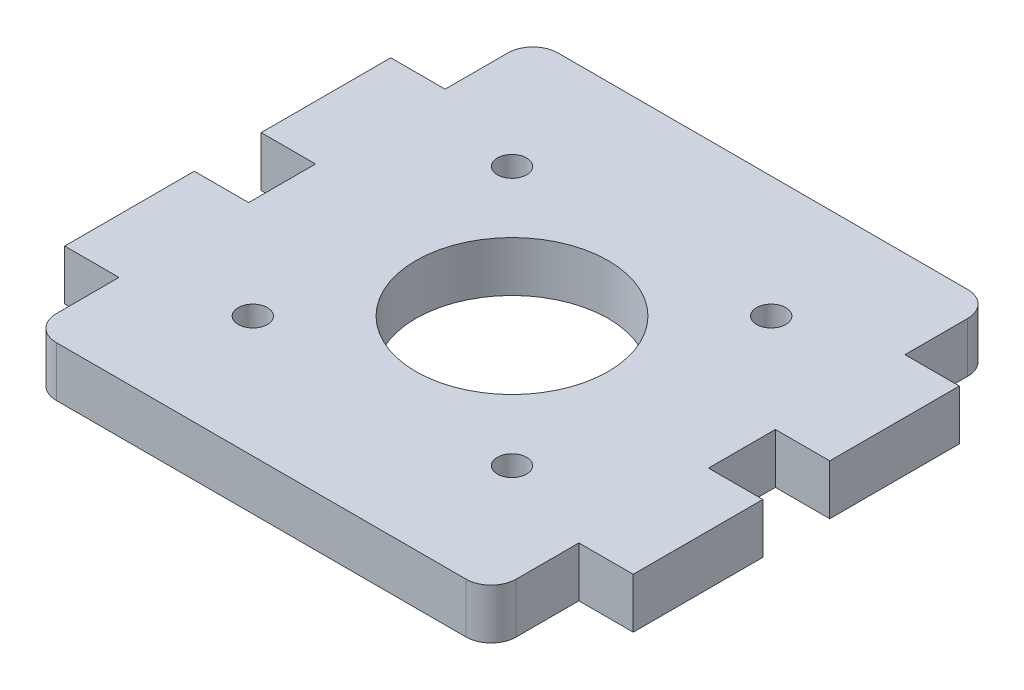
ISO-10303-21;
HEADER;
FILE_DESCRIPTION(('STEP AP214'),'2;1');
FILE_NAME('part.step','',(''),(''),'','','');
FILE_SCHEMA(('AUTOMOTIVE_DESIGN { 1 0 10303 214 1 1 1 1 }'));
ENDSEC;
DATA;
#1=APPLICATION_CONTEXT('core data for automotive mechanical design processes');
#2=APPLICATION_PROTOCOL_DEFINITION('international standard','automotive_design',2000,#1);
#3=PRODUCT_CONTEXT('',#1,'mechanical');
#4=PRODUCT('Part','Part','',(#3));
#5=PRODUCT_RELATED_PRODUCT_CATEGORY('part','',(#4));
#6=PRODUCT_DEFINITION_FORMATION('','',#4);
#7=PRODUCT_DEFINITION_CONTEXT('part definition',#1,'design');
#8=PRODUCT_DEFINITION('design','',#6,#7);
#9=PRODUCT_DEFINITION_SHAPE('','',#8);
#10=(LENGTH_UNIT() NAMED_UNIT(*) SI_UNIT(.MILLI.,.METRE.));
#11=(NAMED_UNIT(*) PLANE_ANGLE_UNIT() SI_UNIT($,.RADIAN.));
#12=(NAMED_UNIT(*) SI_UNIT($,.STERADIAN.) SOLID_ANGLE_UNIT());
#13=UNCERTAINTY_MEASURE_WITH_UNIT(LENGTH_MEASURE(1.E-05),#10,'distance_accuracy_value','');
#14=(GEOMETRIC_REPRESENTATION_CONTEXT(3) GLOBAL_UNCERTAINTY_ASSIGNED_CONTEXT((#13)) GLOBAL_UNIT_ASSIGNED_CONTEXT((#10,
#11,#12)) REPRESENTATION_CONTEXT('',''));
#15=CARTESIAN_POINT('',(0.,0.,0.));
#16=DIRECTION('',(0.,0.,1.));
#17=DIRECTION('',(1.,0.,0.));
#18=AXIS2_PLACEMENT_3D('',#15,#16,#17);
#19=CARTESIAN_POINT('',(-27.5,3.,0.));
#20=DIRECTION('',(-1.,0.,0.));
#21=DIRECTION('',(0.,0.,1.));
#22=AXIS2_PLACEMENT_3D('',#19,#20,#21);
#23=PLANE('',#22);
#24=DIRECTION('',(0.,0.,-1.));
#25=VECTOR('',#24,1.);
#26=CARTESIAN_POINT('',(-27.5,3.,0.));
#27=LINE('',#26,#25);
#28=CARTESIAN_POINT('',(-27.5,3.,-19.5));
#29=VERTEX_POINT('',#28);
#30=CARTESIAN_POINT('',(-27.5,3.,-27.));
#31=VERTEX_POINT('',#30);
#32=EDGE_CURVE('E217',#29,#31,#27,.T.);
#33=ORIENTED_EDGE('',*,*,#32,.T.);
#34=DIRECTION('',(0.,-1.,0.));
#35=VECTOR('',#34,1.);
#36=CARTESIAN_POINT('',(-27.5,3.,-27.));
#37=LINE('',#36,#35);
#38=CARTESIAN_POINT('',(-27.5,-3.,-27.));
#39=VERTEX_POINT('',#38);
#40=EDGE_CURVE('E224',#31,#39,#37,.T.);
#41=ORIENTED_EDGE('',*,*,#40,.T.);
#42=DIRECTION('',(0.,0.,-1.));
#43=VECTOR('',#42,1.);
#44=CARTESIAN_POINT('',(-27.5,-3.,0.));
#45=LINE('',#44,#43);
#46=CARTESIAN_POINT('',(-27.5,-3.,-19.5));
#47=VERTEX_POINT('',#46);
#48=EDGE_CURVE('E220',#47,#39,#45,.T.);
#49=ORIENTED_EDGE('',*,*,#48,.F.);
#50=DIRECTION('',(0.,-1.,0.));
#51=VECTOR('',#50,1.);
#52=CARTESIAN_POINT('',(-27.5,3.,-19.5));
#53=LINE('',#52,#51);
#54=EDGE_CURVE('E213',#29,#47,#53,.T.);
#55=ORIENTED_EDGE('',*,*,#54,.F.);
#56=EDGE_LOOP('',(#33,#41,#49,#55));
#57=FACE_BOUND('',#56,.T.);
#58=ADVANCED_FACE('F51',(#57),#23,.T.);
#59=CARTESIAN_POINT('',(0.,3.,-19.5));
#60=DIRECTION('',(0.,0.,1.));
#61=DIRECTION('',(1.,0.,0.));
#62=AXIS2_PLACEMENT_3D('',#59,#60,#61);
#63=PLANE('',#62);
#64=DIRECTION('',(-1.,0.,0.));
#65=VECTOR('',#64,1.);
#66=CARTESIAN_POINT('',(0.,-3.,-19.5));
#67=LINE('',#66,#65);
#68=CARTESIAN_POINT('',(-34.,-3.,-19.5));
#69=VERTEX_POINT('',#68);
#70=EDGE_CURVE('E308',#47,#69,#67,.T.);
#71=ORIENTED_EDGE('',*,*,#70,.T.);
#72=DIRECTION('',(0.,-1.,0.));
#73=VECTOR('',#72,1.);
#74=CARTESIAN_POINT('',(-34.,3.,-19.5));
#75=LINE('',#74,#73);
#76=CARTESIAN_POINT('',(-34.,3.,-19.5));
#77=VERTEX_POINT('',#76);
#78=EDGE_CURVE('E225',#77,#69,#75,.T.);
#79=ORIENTED_EDGE('',*,*,#78,.F.);
#80=DIRECTION('',(-1.,0.,0.));
#81=VECTOR('',#80,1.);
#82=CARTESIAN_POINT('',(0.,3.,-19.5));
#83=LINE('',#82,#81);
#84=EDGE_CURVE('E229',#29,#77,#83,.T.);
#85=ORIENTED_EDGE('',*,*,#84,.F.);
#86=ORIENTED_EDGE('',*,*,#54,.T.);
#87=EDGE_LOOP('',(#71,#79,#85,#86));
#88=FACE_BOUND('',#87,.T.);
#89=ADVANCED_FACE('F230',(#88),#63,.F.);
#90=CARTESIAN_POINT('',(-34.,3.,0.));
#91=DIRECTION('',(1.,0.,0.));
#92=DIRECTION('',(0.,0.,-1.));
#93=AXIS2_PLACEMENT_3D('',#90,#91,#92);
#94=PLANE('',#93);
#95=DIRECTION('',(0.,0.,1.));
#96=VECTOR('',#95,1.);
#97=CARTESIAN_POINT('',(-34.,-3.,0.));
#98=LINE('',#97,#96);
#99=CARTESIAN_POINT('',(-34.,-3.,-4.));
#100=VERTEX_POINT('',#99);
#101=EDGE_CURVE('E310',#69,#100,#98,.T.);
#102=ORIENTED_EDGE('',*,*,#101,.T.);
#103=DIRECTION('',(0.,-1.,0.));
#104=VECTOR('',#103,1.);
#105=CARTESIAN_POINT('',(-34.,3.,-4.));
#106=LINE('',#105,#104);
#107=CARTESIAN_POINT('',(-34.,3.,-4.));
#108=VERTEX_POINT('',#107);
#109=EDGE_CURVE('E394',#108,#100,#106,.T.);
#110=ORIENTED_EDGE('',*,*,#109,.F.);
#111=DIRECTION('',(0.,0.,1.));
#112=VECTOR('',#111,1.);
#113=CARTESIAN_POINT('',(-34.,3.,0.));
#114=LINE('',#113,#112);
#115=EDGE_CURVE('E232',#77,#108,#114,.T.);
#116=ORIENTED_EDGE('',*,*,#115,.F.);
#117=ORIENTED_EDGE('',*,*,#78,.T.);
#118=EDGE_LOOP('',(#102,#110,#116,#117));
#119=FACE_BOUND('',#118,.T.);
#120=ADVANCED_FACE('F490',(#119),#94,.F.);
#121=CARTESIAN_POINT('',(0.,3.,-4.00000000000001));
#122=DIRECTION('',(0.,0.,1.));
#123=DIRECTION('',(1.,0.,0.));
#124=AXIS2_PLACEMENT_3D('',#121,#122,#123);
#125=PLANE('',#124);
#126=DIRECTION('',(-1.,0.,0.));
#127=VECTOR('',#126,1.);
#128=CARTESIAN_POINT('',(0.,-3.,-4.00000000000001));
#129=LINE('',#128,#127);
#130=CARTESIAN_POINT('',(-27.5,-3.,-4.00000000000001));
#131=VERTEX_POINT('',#130);
#132=EDGE_CURVE('E313',#131,#100,#129,.T.);
#133=ORIENTED_EDGE('',*,*,#132,.F.);
#134=DIRECTION('',(0.,-1.,0.));
#135=VECTOR('',#134,1.);
#136=CARTESIAN_POINT('',(-27.5,3.,-4.00000000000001));
#137=LINE('',#136,#135);
#138=CARTESIAN_POINT('',(-27.5,3.,-4.00000000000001));
#139=VERTEX_POINT('',#138);
#140=EDGE_CURVE('E392',#139,#131,#137,.T.);
#141=ORIENTED_EDGE('',*,*,#140,.F.);
#142=DIRECTION('',(-1.,0.,0.));
#143=VECTOR('',#142,1.);
#144=CARTESIAN_POINT('',(0.,3.,-4.00000000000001));
#145=LINE('',#144,#143);
#146=EDGE_CURVE('E247',#139,#108,#145,.T.);
#147=ORIENTED_EDGE('',*,*,#146,.T.);
#148=ORIENTED_EDGE('',*,*,#109,.T.);
#149=EDGE_LOOP('',(#133,#141,#147,#148));
#150=FACE_BOUND('',#149,.T.);
#151=ADVANCED_FACE('F587',(#150),#125,.T.);
#152=CARTESIAN_POINT('',(-27.5,3.,0.));
#153=DIRECTION('',(-1.,0.,0.));
#154=DIRECTION('',(0.,0.,1.));
#155=AXIS2_PLACEMENT_3D('',#152,#153,#154);
#156=PLANE('',#155);
#157=DIRECTION('',(0.,0.,-1.));
#158=VECTOR('',#157,1.);
#159=CARTESIAN_POINT('',(-27.5,-3.,0.));
#160=LINE('',#159,#158);
#161=CARTESIAN_POINT('',(-27.5,-3.,4.00000000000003));
#162=VERTEX_POINT('',#161);
#163=EDGE_CURVE('E316',#162,#131,#160,.T.);
#164=ORIENTED_EDGE('',*,*,#163,.F.);
#165=DIRECTION('',(0.,-1.,0.));
#166=VECTOR('',#165,1.);
#167=CARTESIAN_POINT('',(-27.5,3.,4.00000000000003));
#168=LINE('',#167,#166);
#169=CARTESIAN_POINT('',(-27.5,3.,4.00000000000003));
#170=VERTEX_POINT('',#169);
#171=EDGE_CURVE('E390',#170,#162,#168,.T.);
#172=ORIENTED_EDGE('',*,*,#171,.F.);
#173=DIRECTION('',(0.,0.,-1.));
#174=VECTOR('',#173,1.);
#175=CARTESIAN_POINT('',(-27.5,3.,0.));
#176=LINE('',#175,#174);
#177=EDGE_CURVE('E250',#170,#139,#176,.T.);
#178=ORIENTED_EDGE('',*,*,#177,.T.);
#179=ORIENTED_EDGE('',*,*,#140,.T.);
#180=EDGE_LOOP('',(#164,#172,#178,#179));
#181=FACE_BOUND('',#180,.T.);
#182=ADVANCED_FACE('F583',(#181),#156,.T.);
#183=CARTESIAN_POINT('',(0.,3.,4.00000000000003));
#184=DIRECTION('',(0.,0.,1.));
#185=DIRECTION('',(1.,0.,0.));
#186=AXIS2_PLACEMENT_3D('',#183,#184,#185);
#187=PLANE('',#186);
#188=DIRECTION('',(-1.,0.,0.));
#189=VECTOR('',#188,1.);
#190=CARTESIAN_POINT('',(0.,-3.,4.00000000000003));
#191=LINE('',#190,#189);
#192=CARTESIAN_POINT('',(-34.,-3.,4.00000000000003));
#193=VERTEX_POINT('',#192);
#194=EDGE_CURVE('E319',#162,#193,#191,.T.);
#195=ORIENTED_EDGE('',*,*,#194,.T.);
#196=DIRECTION('',(0.,-1.,0.));
#197=VECTOR('',#196,1.);
#198=CARTESIAN_POINT('',(-34.,3.,4.00000000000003));
#199=LINE('',#198,#197);
#200=CARTESIAN_POINT('',(-34.,3.,4.00000000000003));
#201=VERTEX_POINT('',#200);
#202=EDGE_CURVE('E388',#201,#193,#199,.T.);
#203=ORIENTED_EDGE('',*,*,#202,.F.);
#204=DIRECTION('',(-1.,0.,0.));
#205=VECTOR('',#204,1.);
#206=CARTESIAN_POINT('',(0.,3.,4.00000000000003));
#207=LINE('',#206,#205);
#208=EDGE_CURVE('E253',#170,#201,#207,.T.);
#209=ORIENTED_EDGE('',*,*,#208,.F.);
#210=ORIENTED_EDGE('',*,*,#171,.T.);
#211=EDGE_LOOP('',(#195,#203,#209,#210));
#212=FACE_BOUND('',#211,.T.);
#213=ADVANCED_FACE('F579',(#212),#187,.F.);
#214=CARTESIAN_POINT('',(-34.,3.,0.));
#215=DIRECTION('',(-1.,0.,0.));
#216=DIRECTION('',(0.,0.,1.));
#217=AXIS2_PLACEMENT_3D('',#214,#215,#216);
#218=PLANE('',#217);
#219=DIRECTION('',(0.,0.,-1.));
#220=VECTOR('',#219,1.);
#221=CARTESIAN_POINT('',(-34.,-3.,0.));
#222=LINE('',#221,#220);
#223=CARTESIAN_POINT('',(-34.,-3.,19.5));
#224=VERTEX_POINT('',#223);
#225=EDGE_CURVE('E322',#224,#193,#222,.T.);
#226=ORIENTED_EDGE('',*,*,#225,.F.);
#227=DIRECTION('',(0.,-1.,0.));
#228=VECTOR('',#227,1.);
#229=CARTESIAN_POINT('',(-34.,3.,19.5));
#230=LINE('',#229,#228);
#231=CARTESIAN_POINT('',(-34.,3.,19.5));
#232=VERTEX_POINT('',#231);
#233=EDGE_CURVE('E386',#232,#224,#230,.T.);
#234=ORIENTED_EDGE('',*,*,#233,.F.);
#235=DIRECTION('',(0.,0.,-1.));
#236=VECTOR('',#235,1.);
#237=CARTESIAN_POINT('',(-34.,3.,0.));
#238=LINE('',#237,#236);
#239=EDGE_CURVE('E255',#232,#201,#238,.T.);
#240=ORIENTED_EDGE('',*,*,#239,.T.);
#241=ORIENTED_EDGE('',*,*,#202,.T.);
#242=EDGE_LOOP('',(#226,#234,#240,#241));
#243=FACE_BOUND('',#242,.T.);
#244=ADVANCED_FACE('F575',(#243),#218,.T.);
#245=CARTESIAN_POINT('',(0.,3.,19.5));
#246=DIRECTION('',(0.,0.,1.));
#247=DIRECTION('',(1.,0.,0.));
#248=AXIS2_PLACEMENT_3D('',#245,#246,#247);
#249=PLANE('',#248);
#250=DIRECTION('',(-1.,0.,0.));
#251=VECTOR('',#250,1.);
#252=CARTESIAN_POINT('',(0.,-3.,19.5));
#253=LINE('',#252,#251);
#254=CARTESIAN_POINT('',(-27.5,-3.,19.5));
#255=VERTEX_POINT('',#254);
#256=EDGE_CURVE('E325',#255,#224,#253,.T.);
#257=ORIENTED_EDGE('',*,*,#256,.F.);
#258=DIRECTION('',(0.,-1.,0.));
#259=VECTOR('',#258,1.);
#260=CARTESIAN_POINT('',(-27.5,3.,19.5));
#261=LINE('',#260,#259);
#262=CARTESIAN_POINT('',(-27.5,3.,19.5));
#263=VERTEX_POINT('',#262);
#264=EDGE_CURVE('E383',#263,#255,#261,.T.);
#265=ORIENTED_EDGE('',*,*,#264,.F.);
#266=DIRECTION('',(-1.,0.,0.));
#267=VECTOR('',#266,1.);
#268=CARTESIAN_POINT('',(0.,3.,19.5));
#269=LINE('',#268,#267);
#270=EDGE_CURVE('E258',#263,#232,#269,.T.);
#271=ORIENTED_EDGE('',*,*,#270,.T.);
#272=ORIENTED_EDGE('',*,*,#233,.T.);
#273=EDGE_LOOP('',(#257,#265,#271,#272));
#274=FACE_BOUND('',#273,.T.);
#275=ADVANCED_FACE('F571',(#274),#249,.T.);
#276=CARTESIAN_POINT('',(-27.5,3.,0.));
#277=DIRECTION('',(-1.,0.,0.));
#278=DIRECTION('',(0.,0.,1.));
#279=AXIS2_PLACEMENT_3D('',#276,#277,#278);
#280=PLANE('',#279);
#281=DIRECTION('',(0.,0.,-1.));
#282=VECTOR('',#281,1.);
#283=CARTESIAN_POINT('',(-27.5,-3.,0.));
#284=LINE('',#283,#282);
#285=CARTESIAN_POINT('',(-27.5,-3.,27.));
#286=VERTEX_POINT('',#285);
#287=EDGE_CURVE('E328',#286,#255,#284,.T.);
#288=ORIENTED_EDGE('',*,*,#287,.F.);
#289=DIRECTION('',(0.,-1.,0.));
#290=VECTOR('',#289,1.);
#291=CARTESIAN_POINT('',(-27.5,3.,27.));
#292=LINE('',#291,#290);
#293=CARTESIAN_POINT('',(-27.5,3.,27.));
#294=VERTEX_POINT('',#293);
#295=EDGE_CURVE('E422',#286,#294,#292,.F.);
#296=ORIENTED_EDGE('',*,*,#295,.T.);
#297=DIRECTION('',(0.,0.,-1.));
#298=VECTOR('',#297,1.);
#299=CARTESIAN_POINT('',(-27.5,3.,0.));
#300=LINE('',#299,#298);
#301=EDGE_CURVE('E261',#294,#263,#300,.T.);
#302=ORIENTED_EDGE('',*,*,#301,.T.);
#303=ORIENTED_EDGE('',*,*,#264,.T.);
#304=EDGE_LOOP('',(#288,#296,#302,#303));
#305=FACE_BOUND('',#304,.T.);
#306=ADVANCED_FACE('F567',(#305),#280,.T.);
#307=CARTESIAN_POINT('',(0.,3.,30.));
#308=DIRECTION('',(0.,0.,-1.));
#309=DIRECTION('',(-1.,0.,0.));
#310=AXIS2_PLACEMENT_3D('',#307,#308,#309);
#311=PLANE('',#310);
#312=DIRECTION('',(1.,0.,0.));
#313=VECTOR('',#312,1.);
#314=CARTESIAN_POINT('',(0.,3.,30.));
#315=LINE('',#314,#313);
#316=CARTESIAN_POINT('',(-24.5,3.,30.));
#317=VERTEX_POINT('',#316);
#318=CARTESIAN_POINT('',(24.5,3.,30.));
#319=VERTEX_POINT('',#318);
#320=EDGE_CURVE('E263',#317,#319,#315,.T.);
#321=ORIENTED_EDGE('',*,*,#320,.F.);
#322=DIRECTION('',(0.,-1.,0.));
#323=VECTOR('',#322,1.);
#324=CARTESIAN_POINT('',(-24.5,-3.,30.));
#325=LINE('',#324,#323);
#326=CARTESIAN_POINT('',(-24.5,-3.,30.));
#327=VERTEX_POINT('',#326);
#328=EDGE_CURVE('E419',#317,#327,#325,.T.);
#329=ORIENTED_EDGE('',*,*,#328,.T.);
#330=DIRECTION('',(1.,0.,0.));
#331=VECTOR('',#330,1.);
#332=CARTESIAN_POINT('',(0.,-3.,30.));
#333=LINE('',#332,#331);
#334=CARTESIAN_POINT('',(24.5,-3.,30.));
#335=VERTEX_POINT('',#334);
#336=EDGE_CURVE('E330',#327,#335,#333,.T.);
#337=ORIENTED_EDGE('',*,*,#336,.T.);
#338=DIRECTION('',(0.,-1.,0.));
#339=VECTOR('',#338,1.);
#340=CARTESIAN_POINT('',(24.5,3.,30.));
#341=LINE('',#340,#339);
#342=EDGE_CURVE('E417',#335,#319,#341,.F.);
#343=ORIENTED_EDGE('',*,*,#342,.T.);
#344=EDGE_LOOP('',(#321,#329,#337,#343));
#345=FACE_BOUND('',#344,.T.);
#346=ADVANCED_FACE('F564',(#345),#311,.F.);
#347=CARTESIAN_POINT('',(27.5,3.,0.));
#348=DIRECTION('',(-1.,0.,0.));
#349=DIRECTION('',(0.,0.,1.));
#350=AXIS2_PLACEMENT_3D('',#347,#348,#349);
#351=PLANE('',#350);
#352=DIRECTION('',(0.,0.,-1.));
#353=VECTOR('',#352,1.);
#354=CARTESIAN_POINT('',(27.5,3.,0.));
#355=LINE('',#354,#353);
#356=CARTESIAN_POINT('',(27.5,3.,27.));
#357=VERTEX_POINT('',#356);
#358=CARTESIAN_POINT('',(27.5,3.,19.5));
#359=VERTEX_POINT('',#358);
#360=EDGE_CURVE('E265',#357,#359,#355,.T.);
#361=ORIENTED_EDGE('',*,*,#360,.F.);
#362=DIRECTION('',(0.,-1.,0.));
#363=VECTOR('',#362,1.);
#364=CARTESIAN_POINT('',(27.5,3.,27.));
#365=LINE('',#364,#363);
#366=CARTESIAN_POINT('',(27.5,-3.,27.));
#367=VERTEX_POINT('',#366);
#368=EDGE_CURVE('E59',#357,#367,#365,.T.);
#369=ORIENTED_EDGE('',*,*,#368,.T.);
#370=DIRECTION('',(0.,0.,-1.));
#371=VECTOR('',#370,1.);
#372=CARTESIAN_POINT('',(27.5,-3.,0.));
#373=LINE('',#372,#371);
#374=CARTESIAN_POINT('',(27.5,-3.,19.5));
#375=VERTEX_POINT('',#374);
#376=EDGE_CURVE('E333',#367,#375,#373,.T.);
#377=ORIENTED_EDGE('',*,*,#376,.T.);
#378=DIRECTION('',(0.,-1.,0.));
#379=VECTOR('',#378,1.);
#380=CARTESIAN_POINT('',(27.5,3.,19.5));
#381=LINE('',#380,#379);
#382=EDGE_CURVE('E380',#359,#375,#381,.T.);
#383=ORIENTED_EDGE('',*,*,#382,.F.);
#384=EDGE_LOOP('',(#361,#369,#377,#383));
#385=FACE_BOUND('',#384,.T.);
#386=ADVANCED_FACE('F427',(#385),#351,.F.);
#387=CARTESIAN_POINT('',(0.,3.,19.4999999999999));
#388=DIRECTION('',(0.,0.,-1.));
#389=DIRECTION('',(-1.,0.,0.));
#390=AXIS2_PLACEMENT_3D('',#387,#388,#389);
#391=PLANE('',#390);
#392=DIRECTION('',(1.,0.,0.));
#393=VECTOR('',#392,1.);
#394=CARTESIAN_POINT('',(0.,-3.,19.4999999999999));
#395=LINE('',#394,#393);
#396=CARTESIAN_POINT('',(34.,-3.,19.5));
#397=VERTEX_POINT('',#396);
#398=EDGE_CURVE('E335',#375,#397,#395,.T.);
#399=ORIENTED_EDGE('',*,*,#398,.T.);
#400=DIRECTION('',(0.,-1.,0.));
#401=VECTOR('',#400,1.);
#402=CARTESIAN_POINT('',(34.,3.,19.5));
#403=LINE('',#402,#401);
#404=CARTESIAN_POINT('',(34.,3.,19.5));
#405=VERTEX_POINT('',#404);
#406=EDGE_CURVE('E377',#405,#397,#403,.T.);
#407=ORIENTED_EDGE('',*,*,#406,.F.);
#408=DIRECTION('',(1.,0.,0.));
#409=VECTOR('',#408,1.);
#410=CARTESIAN_POINT('',(0.,3.,19.4999999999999));
#411=LINE('',#410,#409);
#412=EDGE_CURVE('E267',#359,#405,#411,.T.);
#413=ORIENTED_EDGE('',*,*,#412,.F.);
#414=ORIENTED_EDGE('',*,*,#382,.T.);
#415=EDGE_LOOP('',(#399,#407,#413,#414));
#416=FACE_BOUND('',#415,.T.);
#417=ADVANCED_FACE('F438',(#416),#391,.F.);
#418=CARTESIAN_POINT('',(34.,3.,0.));
#419=DIRECTION('',(-1.,0.,0.));
#420=DIRECTION('',(0.,0.,1.));
#421=AXIS2_PLACEMENT_3D('',#418,#419,#420);
#422=PLANE('',#421);
#423=DIRECTION('',(0.,0.,-1.));
#424=VECTOR('',#423,1.);
#425=CARTESIAN_POINT('',(34.,-3.,0.));
#426=LINE('',#425,#424);
#427=CARTESIAN_POINT('',(34.,-3.,4.00000000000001));
#428=VERTEX_POINT('',#427);
#429=EDGE_CURVE('E338',#397,#428,#426,.T.);
#430=ORIENTED_EDGE('',*,*,#429,.T.);
#431=DIRECTION('',(0.,-1.,0.));
#432=VECTOR('',#431,1.);
#433=CARTESIAN_POINT('',(34.,3.,4.00000000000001));
#434=LINE('',#433,#432);
#435=CARTESIAN_POINT('',(34.,3.,4.00000000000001));
#436=VERTEX_POINT('',#435);
#437=EDGE_CURVE('E375',#436,#428,#434,.T.);
#438=ORIENTED_EDGE('',*,*,#437,.F.);
#439=DIRECTION('',(0.,0.,-1.));
#440=VECTOR('',#439,1.);
#441=CARTESIAN_POINT('',(34.,3.,0.));
#442=LINE('',#441,#440);
#443=EDGE_CURVE('E270',#405,#436,#442,.T.);
#444=ORIENTED_EDGE('',*,*,#443,.F.);
#445=ORIENTED_EDGE('',*,*,#406,.T.);
#446=EDGE_LOOP('',(#430,#438,#444,#445));
#447=FACE_BOUND('',#446,.T.);
#448=ADVANCED_FACE('F442',(#447),#422,.F.);
#449=CARTESIAN_POINT('',(0.,3.,3.99999999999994));
#450=DIRECTION('',(0.,0.,-1.));
#451=DIRECTION('',(-1.,0.,0.));
#452=AXIS2_PLACEMENT_3D('',#449,#450,#451);
#453=PLANE('',#452);
#454=DIRECTION('',(1.,0.,0.));
#455=VECTOR('',#454,1.);
#456=CARTESIAN_POINT('',(0.,-3.,3.99999999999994));
#457=LINE('',#456,#455);
#458=CARTESIAN_POINT('',(27.5,-3.,4.));
#459=VERTEX_POINT('',#458);
#460=EDGE_CURVE('E341',#459,#428,#457,.T.);
#461=ORIENTED_EDGE('',*,*,#460,.F.);
#462=DIRECTION('',(0.,-1.,0.));
#463=VECTOR('',#462,1.);
#464=CARTESIAN_POINT('',(27.5,3.,4.));
#465=LINE('',#464,#463);
#466=CARTESIAN_POINT('',(27.5,3.,4.));
#467=VERTEX_POINT('',#466);
#468=EDGE_CURVE('E373',#467,#459,#465,.T.);
#469=ORIENTED_EDGE('',*,*,#468,.F.);
#470=DIRECTION('',(1.,0.,0.));
#471=VECTOR('',#470,1.);
#472=CARTESIAN_POINT('',(0.,3.,3.99999999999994));
#473=LINE('',#472,#471);
#474=EDGE_CURVE('E272',#467,#436,#473,.T.);
#475=ORIENTED_EDGE('',*,*,#474,.T.);
#476=ORIENTED_EDGE('',*,*,#437,.T.);
#477=EDGE_LOOP('',(#461,#469,#475,#476));
#478=FACE_BOUND('',#477,.T.);
#479=ADVANCED_FACE('F445',(#478),#453,.T.);
#480=CARTESIAN_POINT('',(27.5,3.,0.));
#481=DIRECTION('',(-1.,0.,0.));
#482=DIRECTION('',(0.,0.,1.));
#483=AXIS2_PLACEMENT_3D('',#480,#481,#482);
#484=PLANE('',#483);
#485=DIRECTION('',(0.,0.,-1.));
#486=VECTOR('',#485,1.);
#487=CARTESIAN_POINT('',(27.5,-3.,0.));
#488=LINE('',#487,#486);
#489=CARTESIAN_POINT('',(27.5,-3.,-4.00000000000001));
#490=VERTEX_POINT('',#489);
#491=EDGE_CURVE('E344',#459,#490,#488,.T.);
#492=ORIENTED_EDGE('',*,*,#491,.T.);
#493=DIRECTION('',(0.,-1.,0.));
#494=VECTOR('',#493,1.);
#495=CARTESIAN_POINT('',(27.5,3.,-4.00000000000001));
#496=LINE('',#495,#494);
#497=CARTESIAN_POINT('',(27.5,3.,-4.00000000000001));
#498=VERTEX_POINT('',#497);
#499=EDGE_CURVE('E370',#498,#490,#496,.T.);
#500=ORIENTED_EDGE('',*,*,#499,.F.);
#501=DIRECTION('',(0.,0.,-1.));
#502=VECTOR('',#501,1.);
#503=CARTESIAN_POINT('',(27.5,3.,0.));
#504=LINE('',#503,#502);
#505=EDGE_CURVE('E275',#467,#498,#504,.T.);
#506=ORIENTED_EDGE('',*,*,#505,.F.);
#507=ORIENTED_EDGE('',*,*,#468,.T.);
#508=EDGE_LOOP('',(#492,#500,#506,#507));
#509=FACE_BOUND('',#508,.T.);
#510=ADVANCED_FACE('F450',(#509),#484,.F.);
#511=CARTESIAN_POINT('',(0.,3.,-3.99999999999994));
#512=DIRECTION('',(0.,0.,-1.));
#513=DIRECTION('',(-1.,0.,0.));
#514=AXIS2_PLACEMENT_3D('',#511,#512,#513);
#515=PLANE('',#514);
#516=DIRECTION('',(1.,0.,0.));
#517=VECTOR('',#516,1.);
#518=CARTESIAN_POINT('',(0.,-3.,-3.99999999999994));
#519=LINE('',#518,#517);
#520=CARTESIAN_POINT('',(34.,-3.,-4.00000000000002));
#521=VERTEX_POINT('',#520);
#522=EDGE_CURVE('E347',#490,#521,#519,.T.);
#523=ORIENTED_EDGE('',*,*,#522,.T.);
#524=DIRECTION('',(0.,-1.,0.));
#525=VECTOR('',#524,1.);
#526=CARTESIAN_POINT('',(34.,3.,-4.00000000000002));
#527=LINE('',#526,#525);
#528=CARTESIAN_POINT('',(34.,3.,-4.00000000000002));
#529=VERTEX_POINT('',#528);
#530=EDGE_CURVE('E368',#529,#521,#527,.T.);
#531=ORIENTED_EDGE('',*,*,#530,.F.);
#532=DIRECTION('',(1.,0.,0.));
#533=VECTOR('',#532,1.);
#534=CARTESIAN_POINT('',(0.,3.,-3.99999999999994));
#535=LINE('',#534,#533);
#536=EDGE_CURVE('E278',#498,#529,#535,.T.);
#537=ORIENTED_EDGE('',*,*,#536,.F.);
#538=ORIENTED_EDGE('',*,*,#499,.T.);
#539=EDGE_LOOP('',(#523,#531,#537,#538));
#540=FACE_BOUND('',#539,.T.);
#541=ADVANCED_FACE('F455',(#540),#515,.F.);
#542=CARTESIAN_POINT('',(34.,3.,0.));
#543=DIRECTION('',(1.,0.,0.));
#544=DIRECTION('',(0.,0.,-1.));
#545=AXIS2_PLACEMENT_3D('',#542,#543,#544);
#546=PLANE('',#545);
#547=DIRECTION('',(0.,0.,1.));
#548=VECTOR('',#547,1.);
#549=CARTESIAN_POINT('',(34.,-3.,0.));
#550=LINE('',#549,#548);
#551=CARTESIAN_POINT('',(34.,-3.,-19.5));
#552=VERTEX_POINT('',#551);
#553=EDGE_CURVE('E350',#552,#521,#550,.T.);
#554=ORIENTED_EDGE('',*,*,#553,.F.);
#555=DIRECTION('',(0.,-1.,0.));
#556=VECTOR('',#555,1.);
#557=CARTESIAN_POINT('',(34.,3.,-19.5));
#558=LINE('',#557,#556);
#559=CARTESIAN_POINT('',(34.,3.,-19.5));
#560=VERTEX_POINT('',#559);
#561=EDGE_CURVE('E366',#560,#552,#558,.T.);
#562=ORIENTED_EDGE('',*,*,#561,.F.);
#563=DIRECTION('',(0.,0.,1.));
#564=VECTOR('',#563,1.);
#565=CARTESIAN_POINT('',(34.,3.,0.));
#566=LINE('',#565,#564);
#567=EDGE_CURVE('E280',#560,#529,#566,.T.);
#568=ORIENTED_EDGE('',*,*,#567,.T.);
#569=ORIENTED_EDGE('',*,*,#530,.T.);
#570=EDGE_LOOP('',(#554,#562,#568,#569));
#571=FACE_BOUND('',#570,.T.);
#572=ADVANCED_FACE('F458',(#571),#546,.T.);
#573=CARTESIAN_POINT('',(0.,3.,-19.4999999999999));
#574=DIRECTION('',(0.,0.,-1.));
#575=DIRECTION('',(-1.,0.,0.));
#576=AXIS2_PLACEMENT_3D('',#573,#574,#575);
#577=PLANE('',#576);
#578=DIRECTION('',(1.,0.,0.));
#579=VECTOR('',#578,1.);
#580=CARTESIAN_POINT('',(0.,-3.,-19.4999999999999));
#581=LINE('',#580,#579);
#582=CARTESIAN_POINT('',(27.5,-3.,-19.5));
#583=VERTEX_POINT('',#582);
#584=EDGE_CURVE('E353',#583,#552,#581,.T.);
#585=ORIENTED_EDGE('',*,*,#584,.F.);
#586=DIRECTION('',(0.,-1.,0.));
#587=VECTOR('',#586,1.);
#588=CARTESIAN_POINT('',(27.5,3.,-19.5));
#589=LINE('',#588,#587);
#590=CARTESIAN_POINT('',(27.5,3.,-19.5));
#591=VERTEX_POINT('',#590);
#592=EDGE_CURVE('E294',#591,#583,#589,.T.);
#593=ORIENTED_EDGE('',*,*,#592,.F.);
#594=DIRECTION('',(1.,0.,0.));
#595=VECTOR('',#594,1.);
#596=CARTESIAN_POINT('',(0.,3.,-19.4999999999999));
#597=LINE('',#596,#595);
#598=EDGE_CURVE('E283',#591,#560,#597,.T.);
#599=ORIENTED_EDGE('',*,*,#598,.T.);
#600=ORIENTED_EDGE('',*,*,#561,.T.);
#601=EDGE_LOOP('',(#585,#593,#599,#600));
#602=FACE_BOUND('',#601,.T.);
#603=ADVANCED_FACE('F461',(#602),#577,.T.);
#604=CARTESIAN_POINT('',(27.5,3.,0.));
#605=DIRECTION('',(-1.,0.,0.));
#606=DIRECTION('',(0.,0.,1.));
#607=AXIS2_PLACEMENT_3D('',#604,#605,#606);
#608=PLANE('',#607);
#609=DIRECTION('',(0.,0.,-1.));
#610=VECTOR('',#609,1.);
#611=CARTESIAN_POINT('',(27.5,-3.,0.));
#612=LINE('',#611,#610);
#613=CARTESIAN_POINT('',(27.5,-3.,-27.));
#614=VERTEX_POINT('',#613);
#615=EDGE_CURVE('E356',#583,#614,#612,.T.);
#616=ORIENTED_EDGE('',*,*,#615,.T.);
#617=DIRECTION('',(0.,-1.,0.));
#618=VECTOR('',#617,1.);
#619=CARTESIAN_POINT('',(27.5,3.,-27.));
#620=LINE('',#619,#618);
#621=CARTESIAN_POINT('',(27.5,3.,-27.));
#622=VERTEX_POINT('',#621);
#623=EDGE_CURVE('E13',#614,#622,#620,.F.);
#624=ORIENTED_EDGE('',*,*,#623,.T.);
#625=DIRECTION('',(0.,0.,-1.));
#626=VECTOR('',#625,1.);
#627=CARTESIAN_POINT('',(27.5,3.,0.));
#628=LINE('',#627,#626);
#629=EDGE_CURVE('E286',#591,#622,#628,.T.);
#630=ORIENTED_EDGE('',*,*,#629,.F.);
#631=ORIENTED_EDGE('',*,*,#592,.T.);
#632=EDGE_LOOP('',(#616,#624,#630,#631));
#633=FACE_BOUND('',#632,.T.);
#634=ADVANCED_FACE('F545',(#633),#608,.F.);
#635=CARTESIAN_POINT('',(0.,3.,-30.));
#636=DIRECTION('',(0.,0.,-1.));
#637=DIRECTION('',(-1.,0.,0.));
#638=AXIS2_PLACEMENT_3D('',#635,#636,#637);
#639=PLANE('',#638);
#640=DIRECTION('',(1.,0.,0.));
#641=VECTOR('',#640,1.);
#642=CARTESIAN_POINT('',(0.,-3.,-30.));
#643=LINE('',#642,#641);
#644=CARTESIAN_POINT('',(-24.5,-3.,-30.));
#645=VERTEX_POINT('',#644);
#646=CARTESIAN_POINT('',(24.5,-3.,-30.));
#647=VERTEX_POINT('',#646);
#648=EDGE_CURVE('E358',#645,#647,#643,.T.);
#649=ORIENTED_EDGE('',*,*,#648,.F.);
#650=DIRECTION('',(0.,-1.,0.));
#651=VECTOR('',#650,1.);
#652=CARTESIAN_POINT('',(-24.5,3.,-30.));
#653=LINE('',#652,#651);
#654=CARTESIAN_POINT('',(-24.5,3.,-30.));
#655=VERTEX_POINT('',#654);
#656=EDGE_CURVE('E409',#645,#655,#653,.F.);
#657=ORIENTED_EDGE('',*,*,#656,.T.);
#658=DIRECTION('',(1.,0.,0.));
#659=VECTOR('',#658,1.);
#660=CARTESIAN_POINT('',(0.,3.,-30.));
#661=LINE('',#660,#659);
#662=CARTESIAN_POINT('',(24.5,3.,-30.));
#663=VERTEX_POINT('',#662);
#664=EDGE_CURVE('E288',#655,#663,#661,.T.);
#665=ORIENTED_EDGE('',*,*,#664,.T.);
#666=DIRECTION('',(0.,-1.,0.));
#667=VECTOR('',#666,1.);
#668=CARTESIAN_POINT('',(24.5,-3.,-30.));
#669=LINE('',#668,#667);
#670=EDGE_CURVE('E406',#663,#647,#669,.T.);
#671=ORIENTED_EDGE('',*,*,#670,.T.);
#672=EDGE_LOOP('',(#649,#657,#665,#671));
#673=FACE_BOUND('',#672,.T.);
#674=ADVANCED_FACE('F467',(#673),#639,.T.);
#675=CARTESIAN_POINT('',(0.,3.,0.));
#676=DIRECTION('',(0.,-1.,0.));
#677=DIRECTION('',(0.,0.,-1.));
#678=AXIS2_PLACEMENT_3D('',#675,#676,#677);
#679=CYLINDRICAL_SURFACE('',#678,11.5);
#680=CARTESIAN_POINT('',(0.,3.,0.));
#681=DIRECTION('',(0.,1.,0.));
#682=DIRECTION('',(0.,0.,1.));
#683=AXIS2_PLACEMENT_3D('',#680,#681,#682);
#684=CIRCLE('',#683,11.5);
#685=CARTESIAN_POINT('',(0.,3.,11.5));
#686=VERTEX_POINT('',#685);
#687=EDGE_CURVE('E239',#686,#686,#684,.T.);
#688=ORIENTED_EDGE('',*,*,#687,.T.);
#689=EDGE_LOOP('',(#688));
#690=FACE_BOUND('',#689,.T.);
#691=CARTESIAN_POINT('',(0.,-3.,0.));
#692=DIRECTION('',(0.,1.,0.));
#693=DIRECTION('',(0.,0.,1.));
#694=AXIS2_PLACEMENT_3D('',#691,#692,#693);
#695=CIRCLE('',#694,11.5);
#696=CARTESIAN_POINT('',(0.,-3.,11.5));
#697=VERTEX_POINT('',#696);
#698=EDGE_CURVE('E304',#697,#697,#695,.T.);
#699=ORIENTED_EDGE('',*,*,#698,.F.);
#700=EDGE_LOOP('',(#699));
#701=FACE_BOUND('',#700,.T.);
#702=ADVANCED_FACE('F494',(#690,#701),#679,.F.);
#703=CARTESIAN_POINT('',(15.5,3.,-15.5));
#704=DIRECTION('',(0.,-1.,0.));
#705=DIRECTION('',(0.,0.,-1.));
#706=AXIS2_PLACEMENT_3D('',#703,#704,#705);
#707=CYLINDRICAL_SURFACE('',#706,1.75);
#708=CARTESIAN_POINT('',(15.5,3.,-15.5));
#709=DIRECTION('',(0.,1.,0.));
#710=DIRECTION('',(0.,0.,1.));
#711=AXIS2_PLACEMENT_3D('',#708,#709,#710);
#712=CIRCLE('',#711,1.75);
#713=CARTESIAN_POINT('',(15.5,3.,-13.75));
#714=VERTEX_POINT('',#713);
#715=EDGE_CURVE('E242',#714,#714,#712,.T.);
#716=ORIENTED_EDGE('',*,*,#715,.T.);
#717=EDGE_LOOP('',(#716));
#718=FACE_BOUND('',#717,.T.);
#719=CARTESIAN_POINT('',(15.5,-3.,-15.5));
#720=DIRECTION('',(0.,1.,0.));
#721=DIRECTION('',(0.,0.,1.));
#722=AXIS2_PLACEMENT_3D('',#719,#720,#721);
#723=CIRCLE('',#722,1.75);
#724=CARTESIAN_POINT('',(15.5,-3.,-13.75));
#725=VERTEX_POINT('',#724);
#726=EDGE_CURVE('E301',#725,#725,#723,.T.);
#727=ORIENTED_EDGE('',*,*,#726,.F.);
#728=EDGE_LOOP('',(#727));
#729=FACE_BOUND('',#728,.T.);
#730=ADVANCED_FACE('F497',(#718,#729),#707,.F.);
#731=CARTESIAN_POINT('',(-15.5,3.,-15.5));
#732=DIRECTION('',(0.,-1.,0.));
#733=DIRECTION('',(0.,0.,-1.));
#734=AXIS2_PLACEMENT_3D('',#731,#732,#733);
#735=CYLINDRICAL_SURFACE('',#734,1.75);
#736=CARTESIAN_POINT('',(-15.5,3.,-15.5));
#737=DIRECTION('',(0.,1.,0.));
#738=DIRECTION('',(0.,0.,1.));
#739=AXIS2_PLACEMENT_3D('',#736,#737,#738);
#740=CIRCLE('',#739,1.75);
#741=CARTESIAN_POINT('',(-15.5,3.,-13.75));
#742=VERTEX_POINT('',#741);
#743=EDGE_CURVE('E528',#742,#742,#740,.F.);
#744=ORIENTED_EDGE('',*,*,#743,.F.);
#745=EDGE_LOOP('',(#744));
#746=FACE_BOUND('',#745,.T.);
#747=CARTESIAN_POINT('',(-15.5,-3.,-15.5));
#748=DIRECTION('',(0.,1.,0.));
#749=DIRECTION('',(0.,0.,1.));
#750=AXIS2_PLACEMENT_3D('',#747,#748,#749);
#751=CIRCLE('',#750,1.75);
#752=CARTESIAN_POINT('',(-15.5,-3.,-13.75));
#753=VERTEX_POINT('',#752);
#754=EDGE_CURVE('E298',#753,#753,#751,.F.);
#755=ORIENTED_EDGE('',*,*,#754,.T.);
#756=EDGE_LOOP('',(#755));
#757=FACE_BOUND('',#756,.T.);
#758=ADVANCED_FACE('F501',(#746,#757),#735,.F.);
#759=CARTESIAN_POINT('',(-15.5,3.,15.5));
#760=DIRECTION('',(0.,-1.,0.));
#761=DIRECTION('',(0.,0.,-1.));
#762=AXIS2_PLACEMENT_3D('',#759,#760,#761);
#763=CYLINDRICAL_SURFACE('',#762,1.75);
#764=CARTESIAN_POINT('',(-15.5,3.,15.5));
#765=DIRECTION('',(0.,1.,0.));
#766=DIRECTION('',(0.,0.,1.));
#767=AXIS2_PLACEMENT_3D('',#764,#765,#766);
#768=CIRCLE('',#767,1.75);
#769=CARTESIAN_POINT('',(-15.5,3.,17.25));
#770=VERTEX_POINT('',#769);
#771=EDGE_CURVE('E364',#770,#770,#768,.T.);
#772=ORIENTED_EDGE('',*,*,#771,.T.);
#773=EDGE_LOOP('',(#772));
#774=FACE_BOUND('',#773,.T.);
#775=CARTESIAN_POINT('',(-15.5,-3.,15.5));
#776=DIRECTION('',(0.,1.,0.));
#777=DIRECTION('',(0.,0.,1.));
#778=AXIS2_PLACEMENT_3D('',#775,#776,#777);
#779=CIRCLE('',#778,1.75);
#780=CARTESIAN_POINT('',(-15.5,-3.,17.25));
#781=VERTEX_POINT('',#780);
#782=EDGE_CURVE('E295',#781,#781,#779,.T.);
#783=ORIENTED_EDGE('',*,*,#782,.F.);
#784=EDGE_LOOP('',(#783));
#785=FACE_BOUND('',#784,.T.);
#786=ADVANCED_FACE('F504',(#774,#785),#763,.F.);
#787=CARTESIAN_POINT('',(15.5,3.,15.5));
#788=DIRECTION('',(0.,-1.,0.));
#789=DIRECTION('',(0.,0.,-1.));
#790=AXIS2_PLACEMENT_3D('',#787,#788,#789);
#791=CYLINDRICAL_SURFACE('',#790,1.75);
#792=CARTESIAN_POINT('',(15.5,3.,15.5));
#793=DIRECTION('',(0.,1.,0.));
#794=DIRECTION('',(0.,0.,1.));
#795=AXIS2_PLACEMENT_3D('',#792,#793,#794);
#796=CIRCLE('',#795,1.75);
#797=CARTESIAN_POINT('',(15.5,3.,17.25));
#798=VERTEX_POINT('',#797);
#799=EDGE_CURVE('E291',#798,#798,#796,.F.);
#800=ORIENTED_EDGE('',*,*,#799,.F.);
#801=EDGE_LOOP('',(#800));
#802=FACE_BOUND('',#801,.T.);
#803=CARTESIAN_POINT('',(15.5,-3.,15.5));
#804=DIRECTION('',(0.,1.,0.));
#805=DIRECTION('',(0.,0.,1.));
#806=AXIS2_PLACEMENT_3D('',#803,#804,#805);
#807=CIRCLE('',#806,1.75);
#808=CARTESIAN_POINT('',(15.5,-3.,17.25));
#809=VERTEX_POINT('',#808);
#810=EDGE_CURVE('E361',#809,#809,#807,.F.);
#811=ORIENTED_EDGE('',*,*,#810,.T.);
#812=EDGE_LOOP('',(#811));
#813=FACE_BOUND('',#812,.T.);
#814=ADVANCED_FACE('F507',(#802,#813),#791,.F.);
#815=CARTESIAN_POINT('',(0.,3.,0.));
#816=DIRECTION('',(0.,1.,0.));
#817=DIRECTION('',(0.,0.,1.));
#818=AXIS2_PLACEMENT_3D('',#815,#816,#817);
#819=PLANE('',#818);
#820=ORIENTED_EDGE('',*,*,#771,.F.);
#821=EDGE_LOOP('',(#820));
#822=FACE_BOUND('',#821,.T.);
#823=ORIENTED_EDGE('',*,*,#743,.T.);
#824=EDGE_LOOP('',(#823));
#825=FACE_BOUND('',#824,.T.);
#826=ORIENTED_EDGE('',*,*,#715,.F.);
#827=EDGE_LOOP('',(#826));
#828=FACE_BOUND('',#827,.T.);
#829=ORIENTED_EDGE('',*,*,#687,.F.);
#830=EDGE_LOOP('',(#829));
#831=FACE_BOUND('',#830,.T.);
#832=ORIENTED_EDGE('',*,*,#664,.F.);
#833=CARTESIAN_POINT('',(-24.5,3.,-27.));
#834=DIRECTION('',(0.,1.,0.));
#835=DIRECTION('',(0.,0.,1.));
#836=AXIS2_PLACEMENT_3D('',#833,#834,#835);
#837=CIRCLE('',#836,3.);
#838=EDGE_CURVE('E238',#655,#31,#837,.T.);
#839=ORIENTED_EDGE('',*,*,#838,.T.);
#840=ORIENTED_EDGE('',*,*,#32,.F.);
#841=ORIENTED_EDGE('',*,*,#84,.T.);
#842=ORIENTED_EDGE('',*,*,#115,.T.);
#843=ORIENTED_EDGE('',*,*,#146,.F.);
#844=ORIENTED_EDGE('',*,*,#177,.F.);
#845=ORIENTED_EDGE('',*,*,#208,.T.);
#846=ORIENTED_EDGE('',*,*,#239,.F.);
#847=ORIENTED_EDGE('',*,*,#270,.F.);
#848=ORIENTED_EDGE('',*,*,#301,.F.);
#849=CARTESIAN_POINT('',(-24.5,3.,27.));
#850=DIRECTION('',(0.,1.,0.));
#851=DIRECTION('',(0.,0.,1.));
#852=AXIS2_PLACEMENT_3D('',#849,#850,#851);
#853=CIRCLE('',#852,3.);
#854=EDGE_CURVE('E414',#294,#317,#853,.T.);
#855=ORIENTED_EDGE('',*,*,#854,.T.);
#856=ORIENTED_EDGE('',*,*,#320,.T.);
#857=CARTESIAN_POINT('',(24.5,3.,27.));
#858=DIRECTION('',(0.,1.,0.));
#859=DIRECTION('',(0.,0.,1.));
#860=AXIS2_PLACEMENT_3D('',#857,#858,#859);
#861=CIRCLE('',#860,3.);
#862=EDGE_CURVE('E72',#319,#357,#861,.T.);
#863=ORIENTED_EDGE('',*,*,#862,.T.);
#864=ORIENTED_EDGE('',*,*,#360,.T.);
#865=ORIENTED_EDGE('',*,*,#412,.T.);
#866=ORIENTED_EDGE('',*,*,#443,.T.);
#867=ORIENTED_EDGE('',*,*,#474,.F.);
#868=ORIENTED_EDGE('',*,*,#505,.T.);
#869=ORIENTED_EDGE('',*,*,#536,.T.);
#870=ORIENTED_EDGE('',*,*,#567,.F.);
#871=ORIENTED_EDGE('',*,*,#598,.F.);
#872=ORIENTED_EDGE('',*,*,#629,.T.);
#873=CARTESIAN_POINT('',(24.5,3.,-27.));
#874=DIRECTION('',(0.,1.,0.));
#875=DIRECTION('',(0.,0.,1.));
#876=AXIS2_PLACEMENT_3D('',#873,#874,#875);
#877=CIRCLE('',#876,3.);
#878=EDGE_CURVE('E411',#622,#663,#877,.T.);
#879=ORIENTED_EDGE('',*,*,#878,.T.);
#880=EDGE_LOOP('',(#832,#839,#840,#841,#842,#843,#844,#845,#846,#847,#848,#855,#856,#863,#864,
#865,#866,#867,#868,#869,#870,#871,#872,#879));
#881=FACE_BOUND('',#880,.T.);
#882=ORIENTED_EDGE('',*,*,#799,.T.);
#883=EDGE_LOOP('',(#882));
#884=FACE_BOUND('',#883,.T.);
#885=ADVANCED_FACE('F235',(#822,#825,#828,#831,#881,#884),#819,.T.);
#886=CARTESIAN_POINT('',(0.,-3.,0.));
#887=DIRECTION('',(0.,1.,0.));
#888=DIRECTION('',(0.,0.,1.));
#889=AXIS2_PLACEMENT_3D('',#886,#887,#888);
#890=PLANE('',#889);
#891=ORIENTED_EDGE('',*,*,#782,.T.);
#892=EDGE_LOOP('',(#891));
#893=FACE_BOUND('',#892,.T.);
#894=ORIENTED_EDGE('',*,*,#754,.F.);
#895=EDGE_LOOP('',(#894));
#896=FACE_BOUND('',#895,.T.);
#897=ORIENTED_EDGE('',*,*,#726,.T.);
#898=EDGE_LOOP('',(#897));
#899=FACE_BOUND('',#898,.T.);
#900=ORIENTED_EDGE('',*,*,#698,.T.);
#901=EDGE_LOOP('',(#900));
#902=FACE_BOUND('',#901,.T.);
#903=ORIENTED_EDGE('',*,*,#48,.T.);
#904=CARTESIAN_POINT('',(-24.5,-3.,-27.));
#905=DIRECTION('',(0.,1.,0.));
#906=DIRECTION('',(0.,0.,1.));
#907=AXIS2_PLACEMENT_3D('',#904,#905,#906);
#908=CIRCLE('',#907,3.);
#909=EDGE_CURVE('E404',#39,#645,#908,.F.);
#910=ORIENTED_EDGE('',*,*,#909,.T.);
#911=ORIENTED_EDGE('',*,*,#648,.T.);
#912=CARTESIAN_POINT('',(24.5,-3.,-27.));
#913=DIRECTION('',(0.,1.,0.));
#914=DIRECTION('',(0.,0.,1.));
#915=AXIS2_PLACEMENT_3D('',#912,#913,#914);
#916=CIRCLE('',#915,3.);
#917=EDGE_CURVE('E398',#647,#614,#916,.F.);
#918=ORIENTED_EDGE('',*,*,#917,.T.);
#919=ORIENTED_EDGE('',*,*,#615,.F.);
#920=ORIENTED_EDGE('',*,*,#584,.T.);
#921=ORIENTED_EDGE('',*,*,#553,.T.);
#922=ORIENTED_EDGE('',*,*,#522,.F.);
#923=ORIENTED_EDGE('',*,*,#491,.F.);
#924=ORIENTED_EDGE('',*,*,#460,.T.);
#925=ORIENTED_EDGE('',*,*,#429,.F.);
#926=ORIENTED_EDGE('',*,*,#398,.F.);
#927=ORIENTED_EDGE('',*,*,#376,.F.);
#928=CARTESIAN_POINT('',(24.5,-3.,27.));
#929=DIRECTION('',(0.,1.,0.));
#930=DIRECTION('',(0.,0.,1.));
#931=AXIS2_PLACEMENT_3D('',#928,#929,#930);
#932=CIRCLE('',#931,3.);
#933=EDGE_CURVE('E400',#367,#335,#932,.F.);
#934=ORIENTED_EDGE('',*,*,#933,.T.);
#935=ORIENTED_EDGE('',*,*,#336,.F.);
#936=CARTESIAN_POINT('',(-24.5,-3.,27.));
#937=DIRECTION('',(0.,1.,0.));
#938=DIRECTION('',(0.,0.,1.));
#939=AXIS2_PLACEMENT_3D('',#936,#937,#938);
#940=CIRCLE('',#939,3.);
#941=EDGE_CURVE('E402',#327,#286,#940,.F.);
#942=ORIENTED_EDGE('',*,*,#941,.T.);
#943=ORIENTED_EDGE('',*,*,#287,.T.);
#944=ORIENTED_EDGE('',*,*,#256,.T.);
#945=ORIENTED_EDGE('',*,*,#225,.T.);
#946=ORIENTED_EDGE('',*,*,#194,.F.);
#947=ORIENTED_EDGE('',*,*,#163,.T.);
#948=ORIENTED_EDGE('',*,*,#132,.T.);
#949=ORIENTED_EDGE('',*,*,#101,.F.);
#950=ORIENTED_EDGE('',*,*,#70,.F.);
#951=EDGE_LOOP('',(#903,#910,#911,#918,#919,#920,#921,#922,#923,#924,#925,#926,#927,#934,#935,
#942,#943,#944,#945,#946,#947,#948,#949,#950));
#952=FACE_BOUND('',#951,.T.);
#953=ORIENTED_EDGE('',*,*,#810,.F.);
#954=EDGE_LOOP('',(#953));
#955=FACE_BOUND('',#954,.T.);
#956=ADVANCED_FACE('F432',(#893,#896,#899,#902,#952,#955),#890,.F.);
#957=CARTESIAN_POINT('',(-24.5,3.,-27.));
#958=DIRECTION('',(0.,-1.,0.));
#959=DIRECTION('',(0.,0.,-1.));
#960=AXIS2_PLACEMENT_3D('',#957,#958,#959);
#961=CYLINDRICAL_SURFACE('',#960,3.);
#962=ORIENTED_EDGE('',*,*,#838,.F.);
#963=ORIENTED_EDGE('',*,*,#656,.F.);
#964=ORIENTED_EDGE('',*,*,#909,.F.);
#965=ORIENTED_EDGE('',*,*,#40,.F.);
#966=EDGE_LOOP('',(#962,#963,#964,#965));
#967=FACE_BOUND('',#966,.T.);
#968=ADVANCED_FACE('F471',(#967),#961,.T.);
#969=CARTESIAN_POINT('',(-24.5,3.,27.));
#970=DIRECTION('',(0.,1.,0.));
#971=DIRECTION('',(0.,0.,1.));
#972=AXIS2_PLACEMENT_3D('',#969,#970,#971);
#973=CYLINDRICAL_SURFACE('',#972,3.);
#974=ORIENTED_EDGE('',*,*,#854,.F.);
#975=ORIENTED_EDGE('',*,*,#295,.F.);
#976=ORIENTED_EDGE('',*,*,#941,.F.);
#977=ORIENTED_EDGE('',*,*,#328,.F.);
#978=EDGE_LOOP('',(#974,#975,#976,#977));
#979=FACE_BOUND('',#978,.T.);
#980=ADVANCED_FACE('F473',(#979),#973,.T.);
#981=CARTESIAN_POINT('',(24.5,3.,27.));
#982=DIRECTION('',(0.,-1.,0.));
#983=DIRECTION('',(0.,0.,-1.));
#984=AXIS2_PLACEMENT_3D('',#981,#982,#983);
#985=CYLINDRICAL_SURFACE('',#984,3.);
#986=ORIENTED_EDGE('',*,*,#862,.F.);
#987=ORIENTED_EDGE('',*,*,#342,.F.);
#988=ORIENTED_EDGE('',*,*,#933,.F.);
#989=ORIENTED_EDGE('',*,*,#368,.F.);
#990=EDGE_LOOP('',(#986,#987,#988,#989));
#991=FACE_BOUND('',#990,.T.);
#992=ADVANCED_FACE('F479',(#991),#985,.T.);
#993=CARTESIAN_POINT('',(24.5,3.,-27.));
#994=DIRECTION('',(0.,1.,0.));
#995=DIRECTION('',(0.,0.,1.));
#996=AXIS2_PLACEMENT_3D('',#993,#994,#995);
#997=CYLINDRICAL_SURFACE('',#996,3.);
#998=ORIENTED_EDGE('',*,*,#878,.F.);
#999=ORIENTED_EDGE('',*,*,#623,.F.);
#1000=ORIENTED_EDGE('',*,*,#917,.F.);
#1001=ORIENTED_EDGE('',*,*,#670,.F.);
#1002=EDGE_LOOP('',(#998,#999,#1000,#1001));
#1003=FACE_BOUND('',#1002,.T.);
#1004=ADVANCED_FACE('F53',(#1003),#997,.T.);
#1005=CLOSED_SHELL('',(#58,#89,#120,#151,#182,#213,#244,#275,#306,#346,#386,#417,#448,#479,#510,
#541,#572,#603,#634,#674,#702,#730,#758,#786,#814,#885,#956,#968,#980,#992,#1004));
#1006=MANIFOLD_SOLID_BREP('B2',#1005);
#1007=ADVANCED_BREP_SHAPE_REPRESENTATION('',(#18,#1006),#14);
#1008=SHAPE_DEFINITION_REPRESENTATION(#9,#1007);
ENDSEC;
END-ISO-10303-21;
